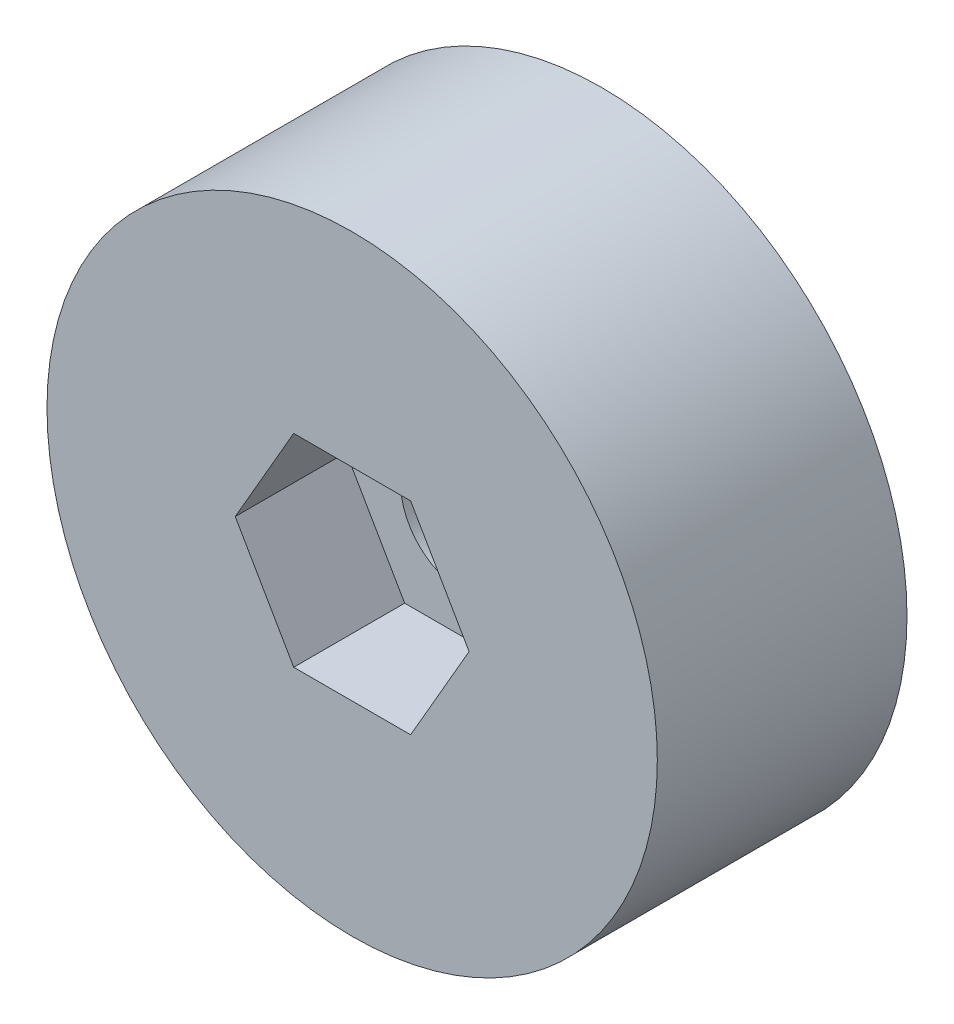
from build123d import *

# Parameters (mm, degrees)
SKETCH_1_R                 = 11
SKETCH_1_R_2               = 2.25
KNOB_M4_THROUGH_DEPTH      = 5
HEX_NUT_POCKET_AF7P3_START = 5
SKETCH_2_R                 = 11
HEX_NUT_POCKET_AF7P3_DEPTH = 4


with BuildPart() as part:
    # Sketch 1 → Knob_M4_through (new body)
    with BuildSketch(Plane.XY):
        Circle(SKETCH_1_R)
        Circle(SKETCH_1_R_2, mode=Mode.SUBTRACT)
    extrude(amount=KNOB_M4_THROUGH_DEPTH)

    # Sketch 2 → Hex_nut_pocket_AF7p3 (add)
    with BuildSketch(Plane.XY.offset(HEX_NUT_POCKET_AF7P3_START)):
        Circle(SKETCH_2_R)
        Polygon((4.214656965, 0), (2.107328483, 3.65), (-2.107328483, 3.65), (-4.214656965, 0), (-2.107328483, -3.65), (2.107328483, -3.65), align=None, mode=Mode.SUBTRACT)
    extrude(amount=HEX_NUT_POCKET_AF7P3_DEPTH)


solid = part.part
